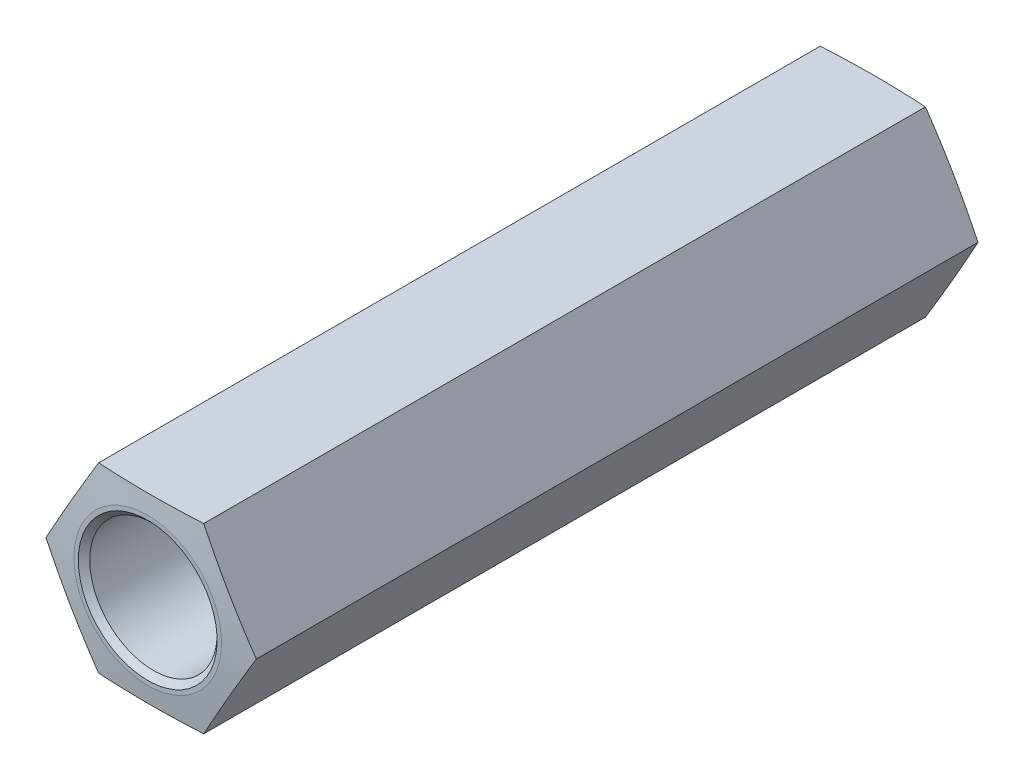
ISO-10303-21;
HEADER;
FILE_DESCRIPTION(('STEP AP214'),'2;1');
FILE_NAME('part.step','',(''),(''),'','','');
FILE_SCHEMA(('AUTOMOTIVE_DESIGN { 1 0 10303 214 1 1 1 1 }'));
ENDSEC;
DATA;
#1=APPLICATION_CONTEXT('core data for automotive mechanical design processes');
#2=APPLICATION_PROTOCOL_DEFINITION('international standard','automotive_design',2000,#1);
#3=PRODUCT_CONTEXT('',#1,'mechanical');
#4=PRODUCT('Part','Part','',(#3));
#5=PRODUCT_RELATED_PRODUCT_CATEGORY('part','',(#4));
#6=PRODUCT_DEFINITION_FORMATION('','',#4);
#7=PRODUCT_DEFINITION_CONTEXT('part definition',#1,'design');
#8=PRODUCT_DEFINITION('design','',#6,#7);
#9=PRODUCT_DEFINITION_SHAPE('','',#8);
#10=(LENGTH_UNIT() NAMED_UNIT(*) SI_UNIT(.MILLI.,.METRE.));
#11=(NAMED_UNIT(*) PLANE_ANGLE_UNIT() SI_UNIT($,.RADIAN.));
#12=(NAMED_UNIT(*) SI_UNIT($,.STERADIAN.) SOLID_ANGLE_UNIT());
#13=UNCERTAINTY_MEASURE_WITH_UNIT(LENGTH_MEASURE(1.E-05),#10,'distance_accuracy_value','');
#14=(GEOMETRIC_REPRESENTATION_CONTEXT(3) GLOBAL_UNCERTAINTY_ASSIGNED_CONTEXT((#13)) GLOBAL_UNIT_ASSIGNED_CONTEXT((#10,
#11,#12)) REPRESENTATION_CONTEXT('',''));
#15=CARTESIAN_POINT('',(0.,0.,0.));
#16=DIRECTION('',(0.,0.,1.));
#17=DIRECTION('',(1.,0.,0.));
#18=AXIS2_PLACEMENT_3D('',#15,#16,#17);
#19=CARTESIAN_POINT('',(3.6427233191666E-08,6.34999999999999,12.7));
#20=DIRECTION('',(0.,0.,-1.));
#21=DIRECTION('',(-1.,0.,0.));
#22=AXIS2_PLACEMENT_3D('',#19,#20,#21);
#23=PLANE('',#22);
#24=CARTESIAN_POINT('',(0.,-6.30938595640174E-08,12.7));
#25=DIRECTION('',(0.,0.,1.));
#26=DIRECTION('',(1.,0.,0.));
#27=AXIS2_PLACEMENT_3D('',#24,#25,#26);
#28=CIRCLE('',#27,2.57273925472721);
#29=CARTESIAN_POINT('',(2.57273925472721,-6.30938595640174E-08,12.7));
#30=VERTEX_POINT('',#29);
#31=EDGE_CURVE('E102',#30,#30,#28,.T.);
#32=ORIENTED_EDGE('',*,*,#31,.T.);
#33=EDGE_LOOP('',(#32));
#34=FACE_BOUND('',#33,.T.);
#35=CARTESIAN_POINT('',(0.,-6.30938595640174E-08,12.7));
#36=DIRECTION('',(0.,0.,-1.));
#37=DIRECTION('',(-1.,0.,0.));
#38=AXIS2_PLACEMENT_3D('',#35,#36,#37);
#39=CIRCLE('',#38,2.42000000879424);
#40=CARTESIAN_POINT('',(-2.42000000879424,-6.30938595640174E-08,12.7));
#41=VERTEX_POINT('',#40);
#42=EDGE_CURVE('E124',#41,#41,#39,.T.);
#43=ORIENTED_EDGE('',*,*,#42,.T.);
#44=EDGE_LOOP('',(#43));
#45=FACE_BOUND('',#44,.T.);
#46=ADVANCED_FACE('F30',(#34,#45),#23,.F.);
#47=CARTESIAN_POINT('',(3.6427233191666E-08,6.34999999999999,-12.7));
#48=DIRECTION('',(0.,0.,-1.));
#49=DIRECTION('',(-1.,0.,0.));
#50=AXIS2_PLACEMENT_3D('',#47,#48,#49);
#51=PLANE('',#50);
#52=CARTESIAN_POINT('',(0.,-6.30938595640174E-08,-12.7));
#53=DIRECTION('',(0.,0.,1.));
#54=DIRECTION('',(1.,0.,0.));
#55=AXIS2_PLACEMENT_3D('',#52,#53,#54);
#56=CIRCLE('',#55,2.57273925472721);
#57=CARTESIAN_POINT('',(2.57273925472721,-6.30938595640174E-08,-12.7));
#58=VERTEX_POINT('',#57);
#59=EDGE_CURVE('E222',#58,#58,#56,.T.);
#60=ORIENTED_EDGE('',*,*,#59,.F.);
#61=EDGE_LOOP('',(#60));
#62=FACE_BOUND('',#61,.T.);
#63=CARTESIAN_POINT('',(0.,-6.30938595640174E-08,-12.7));
#64=DIRECTION('',(0.,0.,-1.));
#65=DIRECTION('',(-1.,0.,0.));
#66=AXIS2_PLACEMENT_3D('',#63,#64,#65);
#67=CIRCLE('',#66,2.42000000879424);
#68=CARTESIAN_POINT('',(-2.42000000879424,-6.30938595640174E-08,-12.7));
#69=VERTEX_POINT('',#68);
#70=EDGE_CURVE('E127',#69,#69,#67,.F.);
#71=ORIENTED_EDGE('',*,*,#70,.T.);
#72=EDGE_LOOP('',(#71));
#73=FACE_BOUND('',#72,.T.);
#74=ADVANCED_FACE('F144',(#62,#73),#51,.T.);
#75=CARTESIAN_POINT('',(-1.83308710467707,3.17499993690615,12.7));
#76=DIRECTION('',(0.866025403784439,-0.5,0.));
#77=DIRECTION('',(0.5,0.866025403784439,0.));
#78=AXIS2_PLACEMENT_3D('',#75,#76,#77);
#79=PLANE('',#78);
#80=DIRECTION('',(0.,0.,-1.));
#81=VECTOR('',#80,1.);
#82=CARTESIAN_POINT('',(-3.66617420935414,-6.30938550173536E-08,12.7));
#83=LINE('',#82,#81);
#84=CARTESIAN_POINT('',(-3.66617420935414,-6.30938541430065E-08,12.58));
#85=VERTEX_POINT('',#84);
#86=CARTESIAN_POINT('',(-3.66617420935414,-6.30938541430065E-08,-12.58));
#87=VERTEX_POINT('',#86);
#88=EDGE_CURVE('E116',#85,#87,#83,.T.);
#89=ORIENTED_EDGE('',*,*,#88,.F.);
#90=CARTESIAN_POINT('',(-3.66628967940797,-0.000200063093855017,12.5799873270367));
#91=CARTESIAN_POINT('',(-3.58994462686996,0.132033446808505,12.5883701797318));
#92=CARTESIAN_POINT('',(-3.51357601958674,0.264307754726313,12.5959650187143));
#93=CARTESIAN_POINT('',(-3.36079345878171,0.528934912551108,12.6092901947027));
#94=CARTESIAN_POINT('',(-3.28437950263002,0.661287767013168,12.6150204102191));
#95=CARTESIAN_POINT('',(-3.13158459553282,0.925936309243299,12.6243226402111));
#96=CARTESIAN_POINT('',(-3.05520367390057,1.05823194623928,12.6278965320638));
#97=CARTESIAN_POINT('',(-2.90242538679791,1.32285170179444,12.6326873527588));
#98=CARTESIAN_POINT('',(-2.82602802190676,1.45517581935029,12.6339043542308));
#99=CARTESIAN_POINT('',(-2.67323329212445,1.719824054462,12.6339043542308));
#100=CARTESIAN_POINT('',(-2.5968359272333,1.85214817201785,12.6326873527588));
#101=CARTESIAN_POINT('',(-2.44405764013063,2.11676792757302,12.6278965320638));
#102=CARTESIAN_POINT('',(-2.36767671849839,2.249063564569,12.6243226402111));
#103=CARTESIAN_POINT('',(-2.21488181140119,2.51371210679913,12.6150204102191));
#104=CARTESIAN_POINT('',(-2.1384678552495,2.64606496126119,12.6092901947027));
#105=CARTESIAN_POINT('',(-1.98568529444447,2.91069211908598,12.5959650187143));
#106=CARTESIAN_POINT('',(-1.90931668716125,3.04296642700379,12.5883701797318));
#107=CARTESIAN_POINT('',(-1.83297163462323,3.17519993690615,12.5799873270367));
#108=B_SPLINE_CURVE_WITH_KNOTS('',3,(#90,#91,#92,#93,#94,#95,#96,#97,#98,#99,#100,#101,#102,
#103,#104,#105,#106,#107),.UNSPECIFIED.,.F.,.F.,(4,2,2,2,2,2,2,2,4),(0.,0.458763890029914,
0.917557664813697,1.37595141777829,1.83433104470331,2.29271067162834,2.75110442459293,
3.20989819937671,3.66866208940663),.UNSPECIFIED.);
#109=CARTESIAN_POINT('',(-1.83308710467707,3.17499993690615,12.58));
#110=VERTEX_POINT('',#109);
#111=EDGE_CURVE('E187',#85,#110,#108,.T.);
#112=ORIENTED_EDGE('',*,*,#111,.T.);
#113=DIRECTION('',(0.,0.,-1.));
#114=VECTOR('',#113,1.);
#115=CARTESIAN_POINT('',(-1.83308710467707,3.17499993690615,12.7));
#116=LINE('',#115,#114);
#117=CARTESIAN_POINT('',(-1.83308710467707,3.17499993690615,-12.58));
#118=VERTEX_POINT('',#117);
#119=EDGE_CURVE('E57',#110,#118,#116,.T.);
#120=ORIENTED_EDGE('',*,*,#119,.T.);
#121=CARTESIAN_POINT('',(-1.83297163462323,3.17519993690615,-12.5799873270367));
#122=CARTESIAN_POINT('',(-1.90931668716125,3.04296642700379,-12.5883701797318));
#123=CARTESIAN_POINT('',(-1.98568529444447,2.91069211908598,-12.5959650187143));
#124=CARTESIAN_POINT('',(-2.1384678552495,2.64606496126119,-12.6092901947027));
#125=CARTESIAN_POINT('',(-2.21488181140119,2.51371210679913,-12.6150204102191));
#126=CARTESIAN_POINT('',(-2.36767671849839,2.249063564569,-12.6243226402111));
#127=CARTESIAN_POINT('',(-2.44405764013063,2.11676792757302,-12.6278965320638));
#128=CARTESIAN_POINT('',(-2.5968359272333,1.85214817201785,-12.6326873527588));
#129=CARTESIAN_POINT('',(-2.67323329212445,1.719824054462,-12.6339043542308));
#130=CARTESIAN_POINT('',(-2.82602802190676,1.45517581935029,-12.6339043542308));
#131=CARTESIAN_POINT('',(-2.90242538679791,1.32285170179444,-12.6326873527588));
#132=CARTESIAN_POINT('',(-3.05520367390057,1.05823194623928,-12.6278965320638));
#133=CARTESIAN_POINT('',(-3.13158459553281,0.925936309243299,-12.6243226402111));
#134=CARTESIAN_POINT('',(-3.28437950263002,0.661287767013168,-12.6150204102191));
#135=CARTESIAN_POINT('',(-3.36079345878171,0.528934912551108,-12.6092901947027));
#136=CARTESIAN_POINT('',(-3.51357601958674,0.264307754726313,-12.5959650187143));
#137=CARTESIAN_POINT('',(-3.58994462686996,0.132033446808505,-12.5883701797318));
#138=CARTESIAN_POINT('',(-3.66628967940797,-0.000200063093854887,-12.5799873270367));
#139=B_SPLINE_CURVE_WITH_KNOTS('',3,(#121,#122,#123,#124,#125,#126,#127,#128,#129,#130,#131,
#132,#133,#134,#135,#136,#137,#138),.UNSPECIFIED.,.F.,.F.,(4,2,2,2,2,2,2,2,4),(0.,
0.458763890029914,0.917557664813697,1.37595141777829,1.83433104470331,2.29271067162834,
2.75110442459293,3.20989819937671,3.66866208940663),.UNSPECIFIED.);
#140=EDGE_CURVE('E209',#118,#87,#139,.T.);
#141=ORIENTED_EDGE('',*,*,#140,.T.);
#142=EDGE_LOOP('',(#89,#112,#120,#141));
#143=FACE_BOUND('',#142,.T.);
#144=ADVANCED_FACE('F196',(#143),#79,.F.);
#145=CARTESIAN_POINT('',(-3.66617420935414,-6.30938550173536E-08,12.7));
#146=DIRECTION('',(0.866025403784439,0.5,0.));
#147=DIRECTION('',(-0.5,0.866025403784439,0.));
#148=AXIS2_PLACEMENT_3D('',#145,#146,#147);
#149=PLANE('',#148);
#150=DIRECTION('',(0.,0.,-1.));
#151=VECTOR('',#150,1.);
#152=CARTESIAN_POINT('',(-1.83308710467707,-3.17500006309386,12.7));
#153=LINE('',#152,#151);
#154=CARTESIAN_POINT('',(-1.83308710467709,-3.17500006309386,12.58));
#155=VERTEX_POINT('',#154);
#156=CARTESIAN_POINT('',(-1.83308710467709,-3.17500006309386,-12.58));
#157=VERTEX_POINT('',#156);
#158=EDGE_CURVE('E110',#155,#157,#153,.T.);
#159=ORIENTED_EDGE('',*,*,#158,.F.);
#160=CARTESIAN_POINT('',(-1.83297163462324,-3.17520006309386,12.5799873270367));
#161=CARTESIAN_POINT('',(-1.90931668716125,-3.0429665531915,12.5883701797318));
#162=CARTESIAN_POINT('',(-1.98568529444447,-2.91069224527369,12.5959650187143));
#163=CARTESIAN_POINT('',(-2.1384678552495,-2.6460650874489,12.6092901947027));
#164=CARTESIAN_POINT('',(-2.21488181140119,-2.51371223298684,12.6150204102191));
#165=CARTESIAN_POINT('',(-2.36767671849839,-2.24906369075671,12.6243226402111));
#166=CARTESIAN_POINT('',(-2.44405764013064,-2.11676805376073,12.6278965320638));
#167=CARTESIAN_POINT('',(-2.5968359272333,-1.85214829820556,12.6326873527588));
#168=CARTESIAN_POINT('',(-2.67323329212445,-1.71982418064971,12.6339043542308));
#169=CARTESIAN_POINT('',(-2.82602802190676,-1.455175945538,12.6339043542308));
#170=CARTESIAN_POINT('',(-2.90242538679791,-1.32285182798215,12.6326873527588));
#171=CARTESIAN_POINT('',(-3.05520367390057,-1.05823207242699,12.6278965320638));
#172=CARTESIAN_POINT('',(-3.13158459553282,-0.925936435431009,12.6243226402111));
#173=CARTESIAN_POINT('',(-3.28437950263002,-0.661287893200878,12.6150204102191));
#174=CARTESIAN_POINT('',(-3.36079345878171,-0.528935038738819,12.6092901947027));
#175=CARTESIAN_POINT('',(-3.51357601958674,-0.264307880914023,12.5959650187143));
#176=CARTESIAN_POINT('',(-3.58994462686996,-0.132033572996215,12.5883701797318));
#177=CARTESIAN_POINT('',(-3.66628967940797,0.000199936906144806,12.5799873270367));
#178=B_SPLINE_CURVE_WITH_KNOTS('',3,(#160,#161,#162,#163,#164,#165,#166,#167,#168,#169,#170,
#171,#172,#173,#174,#175,#176,#177),.UNSPECIFIED.,.F.,.F.,(4,2,2,2,2,2,2,2,4),(0.,
0.458763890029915,0.917557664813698,1.37595141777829,1.83433104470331,2.29271067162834,
2.75110442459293,3.20989819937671,3.66866208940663),.UNSPECIFIED.);
#179=EDGE_CURVE('E181',#155,#85,#178,.T.);
#180=ORIENTED_EDGE('',*,*,#179,.T.);
#181=ORIENTED_EDGE('',*,*,#88,.T.);
#182=CARTESIAN_POINT('',(-3.66628967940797,0.000199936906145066,-12.5799873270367));
#183=CARTESIAN_POINT('',(-3.58994462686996,-0.132033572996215,-12.5883701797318));
#184=CARTESIAN_POINT('',(-3.51357601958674,-0.264307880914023,-12.5959650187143));
#185=CARTESIAN_POINT('',(-3.36079345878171,-0.528935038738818,-12.6092901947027));
#186=CARTESIAN_POINT('',(-3.28437950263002,-0.661287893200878,-12.6150204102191));
#187=CARTESIAN_POINT('',(-3.13158459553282,-0.925936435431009,-12.6243226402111));
#188=CARTESIAN_POINT('',(-3.05520367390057,-1.05823207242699,-12.6278965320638));
#189=CARTESIAN_POINT('',(-2.90242538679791,-1.32285182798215,-12.6326873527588));
#190=CARTESIAN_POINT('',(-2.82602802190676,-1.455175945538,-12.6339043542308));
#191=CARTESIAN_POINT('',(-2.67323329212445,-1.71982418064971,-12.6339043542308));
#192=CARTESIAN_POINT('',(-2.5968359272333,-1.85214829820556,-12.6326873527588));
#193=CARTESIAN_POINT('',(-2.44405764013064,-2.11676805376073,-12.6278965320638));
#194=CARTESIAN_POINT('',(-2.36767671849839,-2.24906369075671,-12.6243226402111));
#195=CARTESIAN_POINT('',(-2.21488181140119,-2.51371223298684,-12.6150204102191));
#196=CARTESIAN_POINT('',(-2.1384678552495,-2.6460650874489,-12.6092901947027));
#197=CARTESIAN_POINT('',(-1.98568529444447,-2.91069224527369,-12.5959650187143));
#198=CARTESIAN_POINT('',(-1.90931668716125,-3.0429665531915,-12.5883701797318));
#199=CARTESIAN_POINT('',(-1.83297163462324,-3.17520006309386,-12.5799873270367));
#200=B_SPLINE_CURVE_WITH_KNOTS('',3,(#182,#183,#184,#185,#186,#187,#188,#189,#190,#191,#192,
#193,#194,#195,#196,#197,#198,#199),.UNSPECIFIED.,.F.,.F.,(4,2,2,2,2,2,2,2,4),(0.,
0.458763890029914,0.917557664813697,1.37595141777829,1.83433104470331,2.29271067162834,
2.75110442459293,3.20989819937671,3.66866208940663),.UNSPECIFIED.);
#201=EDGE_CURVE('E202',#87,#157,#200,.T.);
#202=ORIENTED_EDGE('',*,*,#201,.T.);
#203=EDGE_LOOP('',(#159,#180,#181,#202));
#204=FACE_BOUND('',#203,.T.);
#205=ADVANCED_FACE('F192',(#204),#149,.F.);
#206=CARTESIAN_POINT('',(-1.83308710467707,-3.17500006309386,12.7));
#207=DIRECTION('',(-3.44194550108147E-08,0.999999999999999,0.));
#208=DIRECTION('',(-0.999999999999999,-3.44194550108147E-08,0.));
#209=AXIS2_PLACEMENT_3D('',#206,#207,#208);
#210=PLANE('',#209);
#211=DIRECTION('',(0.,0.,-1.));
#212=VECTOR('',#211,1.);
#213=CARTESIAN_POINT('',(1.83308710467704,-3.17499993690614,12.7));
#214=LINE('',#213,#212);
#215=CARTESIAN_POINT('',(1.83308699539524,-3.17500012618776,12.58));
#216=VERTEX_POINT('',#215);
#217=CARTESIAN_POINT('',(1.83308699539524,-3.17500012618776,-12.58));
#218=VERTEX_POINT('',#217);
#219=EDGE_CURVE('E108',#216,#218,#214,.T.);
#220=ORIENTED_EDGE('',*,*,#219,.F.);
#221=CARTESIAN_POINT('',(-4.83494791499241,-3.17500016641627,12.3475517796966));
#222=CARTESIAN_POINT('',(-4.69083344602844,-3.17500016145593,12.3607700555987));
#223=CARTESIAN_POINT('',(-4.54670317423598,-3.17500015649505,12.3738162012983));
#224=CARTESIAN_POINT('',(-4.25840335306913,-3.17500014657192,12.3994791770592));
#225=CARTESIAN_POINT('',(-4.11423380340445,-3.17500014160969,12.4120960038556));
#226=CARTESIAN_POINT('',(-3.68161123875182,-3.17500012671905,12.4491786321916));
#227=CARTESIAN_POINT('',(-3.39309105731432,-3.17500011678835,12.4728722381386));
#228=CARTESIAN_POINT('',(-2.81617995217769,-3.17500009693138,12.5171363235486));
#229=CARTESIAN_POINT('',(-2.52778933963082,-3.17500008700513,12.5377107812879));
#230=CARTESIAN_POINT('',(-1.95071438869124,-3.17500006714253,12.574212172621));
#231=CARTESIAN_POINT('',(-1.66203005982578,-3.17500005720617,12.5901392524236));
#232=CARTESIAN_POINT('',(-1.08383678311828,-3.17500003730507,12.6153055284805));
#233=CARTESIAN_POINT('',(-0.794327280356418,-3.17500002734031,12.6245328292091));
#234=CARTESIAN_POINT('',(-0.359965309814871,-3.17500001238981,12.6320264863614));
#235=CARTESIAN_POINT('',(-0.215165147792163,-3.17500000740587,12.6334665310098));
#236=CARTESIAN_POINT('',(0.0744404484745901,-3.1749999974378,12.6341710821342));
#237=CARTESIAN_POINT('',(0.21924588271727,-3.17499999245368,12.6334355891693));
#238=CARTESIAN_POINT('',(0.653794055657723,-3.17499997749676,12.6279910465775));
#239=CARTESIAN_POINT('',(0.943499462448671,-3.17499996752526,12.6200410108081));
#240=CARTESIAN_POINT('',(1.5226385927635,-3.17499994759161,12.5970571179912));
#241=CARTESIAN_POINT('',(1.81207228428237,-3.17499993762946,12.5820225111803));
#242=CARTESIAN_POINT('',(2.37658945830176,-3.17499991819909,12.5478298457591));
#243=CARTESIAN_POINT('',(2.65168769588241,-3.17499990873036,12.5289073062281));
#244=CARTESIAN_POINT('',(3.20165867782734,-3.17499988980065,12.4879990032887));
#245=CARTESIAN_POINT('',(3.47653141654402,-3.17499988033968,12.4660131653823));
#246=CARTESIAN_POINT('',(4.02611836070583,-3.1749998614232,12.419972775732));
#247=CARTESIAN_POINT('',(4.30083255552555,-3.17499985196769,12.3959180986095));
#248=CARTESIAN_POINT('',(4.85013324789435,-3.17499983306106,12.3463896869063));
#249=CARTESIAN_POINT('',(5.12471974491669,-3.17499982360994,12.3209159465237));
#250=CARTESIAN_POINT('',(5.6733434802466,-3.17499980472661,12.2690145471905));
#251=CARTESIAN_POINT('',(5.94738087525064,-3.17499979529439,12.2425885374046));
#252=CARTESIAN_POINT('',(6.49538629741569,-3.17499977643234,12.1890190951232));
#253=CARTESIAN_POINT('',(6.76935432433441,-3.17499976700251,12.161875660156));
#254=CARTESIAN_POINT('',(7.31716608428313,-3.17499974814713,12.1070676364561));
#255=CARTESIAN_POINT('',(7.59100983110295,-3.17499973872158,12.0794031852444));
#256=CARTESIAN_POINT('',(8.13865420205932,-3.17499971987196,12.0236676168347));
#257=CARTESIAN_POINT('',(8.41245482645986,-3.17499971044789,11.9955965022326));
#258=CARTESIAN_POINT('',(8.6862405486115,-3.17499970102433,11.9673825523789));
#259=B_SPLINE_CURVE_WITH_KNOTS('',3,(#221,#222,#223,#224,#225,#226,#227,#228,#229,#230,#231,
#232,#233,#234,#235,#236,#237,#238,#239,#240,#241,#242,#243,#244,#245,#246,#247,#248,#249,#250,
#251,#252,#253,#254,#255,#256,#257,#258),.UNSPECIFIED.,.F.,.F.,(4,2,2,2,2,2,2,2,2,2,2,2,2,2,2,2,
2,2,4),(0.,0.434157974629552,0.86831925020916,1.7367826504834,2.60412888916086,3.47144783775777,
4.34030297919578,4.77470987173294,5.20911665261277,6.07843767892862,6.94785072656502,
7.77507130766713,8.60231200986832,9.42960288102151,10.2568971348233,11.0828216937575,
11.9087490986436,12.734461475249,13.5601685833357),.UNSPECIFIED.);
#260=EDGE_CURVE('E90',#216,#155,#259,.F.);
#261=ORIENTED_EDGE('',*,*,#260,.T.);
#262=ORIENTED_EDGE('',*,*,#158,.T.);
#263=CARTESIAN_POINT('',(-4.83494791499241,-3.17500016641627,-12.3475517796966));
#264=CARTESIAN_POINT('',(-4.69083344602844,-3.17500016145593,-12.3607700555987));
#265=CARTESIAN_POINT('',(-4.54670317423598,-3.17500015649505,-12.3738162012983));
#266=CARTESIAN_POINT('',(-4.25840335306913,-3.17500014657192,-12.3994791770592));
#267=CARTESIAN_POINT('',(-4.11423380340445,-3.17500014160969,-12.4120960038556));
#268=CARTESIAN_POINT('',(-3.68161123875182,-3.17500012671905,-12.4491786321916));
#269=CARTESIAN_POINT('',(-3.39309105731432,-3.17500011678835,-12.4728722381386));
#270=CARTESIAN_POINT('',(-2.81617995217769,-3.17500009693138,-12.5171363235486));
#271=CARTESIAN_POINT('',(-2.52778933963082,-3.17500008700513,-12.5377107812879));
#272=CARTESIAN_POINT('',(-1.95071438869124,-3.17500006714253,-12.574212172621));
#273=CARTESIAN_POINT('',(-1.66203005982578,-3.17500005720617,-12.5901392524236));
#274=CARTESIAN_POINT('',(-1.08383678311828,-3.17500003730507,-12.6153055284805));
#275=CARTESIAN_POINT('',(-0.794327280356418,-3.17500002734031,-12.6245328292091));
#276=CARTESIAN_POINT('',(-0.359965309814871,-3.17500001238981,-12.6320264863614));
#277=CARTESIAN_POINT('',(-0.215165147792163,-3.17500000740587,-12.6334665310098));
#278=CARTESIAN_POINT('',(0.0744404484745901,-3.1749999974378,-12.6341710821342));
#279=CARTESIAN_POINT('',(0.21924588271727,-3.17499999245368,-12.6334355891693));
#280=CARTESIAN_POINT('',(0.653794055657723,-3.17499997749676,-12.6279910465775));
#281=CARTESIAN_POINT('',(0.943499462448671,-3.17499996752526,-12.6200410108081));
#282=CARTESIAN_POINT('',(1.5226385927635,-3.17499994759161,-12.5970571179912));
#283=CARTESIAN_POINT('',(1.81207228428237,-3.17499993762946,-12.5820225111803));
#284=CARTESIAN_POINT('',(2.37658945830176,-3.17499991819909,-12.5478298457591));
#285=CARTESIAN_POINT('',(2.65168769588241,-3.17499990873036,-12.5289073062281));
#286=CARTESIAN_POINT('',(3.20165867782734,-3.17499988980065,-12.4879990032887));
#287=CARTESIAN_POINT('',(3.47653141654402,-3.17499988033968,-12.4660131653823));
#288=CARTESIAN_POINT('',(4.02611836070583,-3.1749998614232,-12.419972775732));
#289=CARTESIAN_POINT('',(4.30083255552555,-3.17499985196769,-12.3959180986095));
#290=CARTESIAN_POINT('',(4.85013324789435,-3.17499983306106,-12.3463896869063));
#291=CARTESIAN_POINT('',(5.12471974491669,-3.17499982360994,-12.3209159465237));
#292=CARTESIAN_POINT('',(5.6733434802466,-3.17499980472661,-12.2690145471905));
#293=CARTESIAN_POINT('',(5.94738087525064,-3.17499979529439,-12.2425885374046));
#294=CARTESIAN_POINT('',(6.49538629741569,-3.17499977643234,-12.1890190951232));
#295=CARTESIAN_POINT('',(6.76935432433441,-3.17499976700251,-12.161875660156));
#296=CARTESIAN_POINT('',(7.31716608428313,-3.17499974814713,-12.1070676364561));
#297=CARTESIAN_POINT('',(7.59100983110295,-3.17499973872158,-12.0794031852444));
#298=CARTESIAN_POINT('',(8.13865420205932,-3.17499971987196,-12.0236676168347));
#299=CARTESIAN_POINT('',(8.41245482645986,-3.17499971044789,-11.9955965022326));
#300=CARTESIAN_POINT('',(8.6862405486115,-3.17499970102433,-11.9673825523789));
#301=B_SPLINE_CURVE_WITH_KNOTS('',3,(#263,#264,#265,#266,#267,#268,#269,#270,#271,#272,#273,
#274,#275,#276,#277,#278,#279,#280,#281,#282,#283,#284,#285,#286,#287,#288,#289,#290,#291,#292,
#293,#294,#295,#296,#297,#298,#299,#300),.UNSPECIFIED.,.F.,.F.,(4,2,2,2,2,2,2,2,2,2,2,2,2,2,2,2,
2,2,4),(0.,0.434157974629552,0.86831925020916,1.7367826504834,2.60412888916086,3.47144783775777,
4.34030297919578,4.77470987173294,5.20911665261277,6.07843767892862,6.94785072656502,
7.77507130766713,8.60231200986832,9.42960288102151,10.2568971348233,11.0828216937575,
11.9087490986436,12.734461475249,13.5601685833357),.UNSPECIFIED.);
#302=EDGE_CURVE('E210',#157,#218,#301,.T.);
#303=ORIENTED_EDGE('',*,*,#302,.T.);
#304=EDGE_LOOP('',(#220,#261,#262,#303));
#305=FACE_BOUND('',#304,.T.);
#306=ADVANCED_FACE('F195',(#305),#210,.F.);
#307=CARTESIAN_POINT('',(1.83308710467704,-3.17499993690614,12.7));
#308=DIRECTION('',(-0.866025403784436,0.500000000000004,0.));
#309=DIRECTION('',(-0.500000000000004,-0.866025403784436,0.));
#310=AXIS2_PLACEMENT_3D('',#307,#308,#309);
#311=PLANE('',#310);
#312=DIRECTION('',(0.,0.,-1.));
#313=VECTOR('',#312,1.);
#314=CARTESIAN_POINT('',(3.66617420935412,6.3093853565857E-08,12.7));
#315=LINE('',#314,#313);
#316=CARTESIAN_POINT('',(3.66617420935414,6.30938224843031E-08,12.58));
#317=VERTEX_POINT('',#316);
#318=CARTESIAN_POINT('',(3.66617420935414,6.30938224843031E-08,-12.58));
#319=VERTEX_POINT('',#318);
#320=EDGE_CURVE('E99',#317,#319,#315,.T.);
#321=ORIENTED_EDGE('',*,*,#320,.F.);
#322=CARTESIAN_POINT('',(3.66628967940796,0.000200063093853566,12.5799873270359));
#323=CARTESIAN_POINT('',(3.58994462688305,-0.132033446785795,12.5883701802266));
#324=CARTESIAN_POINT('',(3.51357601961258,-0.264307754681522,12.5959650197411));
#325=CARTESIAN_POINT('',(3.36079345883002,-0.528934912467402,12.6092901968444));
#326=CARTESIAN_POINT('',(3.28437950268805,-0.661287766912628,12.6150204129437));
#327=CARTESIAN_POINT('',(3.13158459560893,-0.925936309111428,12.6243226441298));
#328=CARTESIAN_POINT('',(3.05520367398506,-1.0582319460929,12.6278965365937));
#329=CARTESIAN_POINT('',(2.90242538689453,-1.32285170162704,12.6326873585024));
#330=CARTESIAN_POINT('',(2.82602802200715,-1.45517581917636,12.6339043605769));
#331=CARTESIAN_POINT('',(2.67323329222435,-1.71982405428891,12.6339043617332));
#332=CARTESIAN_POINT('',(2.59683592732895,-1.85214817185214,12.6326873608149));
#333=CARTESIAN_POINT('',(2.44405764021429,-2.11676792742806,12.6278965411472));
#334=CARTESIAN_POINT('',(2.36767671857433,-2.24906356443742,12.6243226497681));
#335=CARTESIAN_POINT('',(2.21488181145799,-2.51371210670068,12.6150204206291));
#336=CARTESIAN_POINT('',(2.1384678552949,-2.64606496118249,12.6092902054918));
#337=CARTESIAN_POINT('',(1.9856852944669,-2.91069211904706,12.5959650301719));
#338=CARTESIAN_POINT('',(1.90931668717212,-3.0429664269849,12.5883701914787));
#339=CARTESIAN_POINT('',(1.8329716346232,-3.17519993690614,12.5799873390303));
#340=B_SPLINE_CURVE_WITH_KNOTS('',3,(#322,#323,#324,#325,#326,#327,#328,#329,#330,#331,#332,
#333,#334,#335,#336,#337,#338,#339),.UNSPECIFIED.,.F.,.F.,(4,2,2,2,2,2,2,2,4),(0.,
0.45876389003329,0.917557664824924,1.37595141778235,1.8343310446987,2.29271067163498,
2.75110442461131,3.20989819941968,3.66866208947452),.UNSPECIFIED.);
#341=EDGE_CURVE('E87',#317,#216,#340,.T.);
#342=ORIENTED_EDGE('',*,*,#341,.T.);
#343=ORIENTED_EDGE('',*,*,#219,.T.);
#344=CARTESIAN_POINT('',(1.8329716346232,-3.17519993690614,-12.5799873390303));
#345=CARTESIAN_POINT('',(1.90931668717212,-3.0429664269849,-12.5883701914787));
#346=CARTESIAN_POINT('',(1.9856852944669,-2.91069211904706,-12.5959650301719));
#347=CARTESIAN_POINT('',(2.1384678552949,-2.64606496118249,-12.6092902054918));
#348=CARTESIAN_POINT('',(2.21488181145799,-2.51371210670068,-12.6150204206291));
#349=CARTESIAN_POINT('',(2.36767671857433,-2.24906356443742,-12.6243226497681));
#350=CARTESIAN_POINT('',(2.44405764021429,-2.11676792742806,-12.6278965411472));
#351=CARTESIAN_POINT('',(2.59683592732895,-1.85214817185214,-12.6326873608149));
#352=CARTESIAN_POINT('',(2.67323329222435,-1.71982405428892,-12.6339043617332));
#353=CARTESIAN_POINT('',(2.82602802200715,-1.45517581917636,-12.6339043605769));
#354=CARTESIAN_POINT('',(2.90242538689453,-1.32285170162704,-12.6326873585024));
#355=CARTESIAN_POINT('',(3.05520367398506,-1.0582319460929,-12.6278965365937));
#356=CARTESIAN_POINT('',(3.13158459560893,-0.925936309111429,-12.6243226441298));
#357=CARTESIAN_POINT('',(3.28437950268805,-0.661287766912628,-12.6150204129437));
#358=CARTESIAN_POINT('',(3.36079345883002,-0.528934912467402,-12.6092901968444));
#359=CARTESIAN_POINT('',(3.51357601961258,-0.264307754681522,-12.5959650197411));
#360=CARTESIAN_POINT('',(3.58994462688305,-0.132033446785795,-12.5883701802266));
#361=CARTESIAN_POINT('',(3.66628967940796,0.000200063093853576,-12.5799873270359));
#362=B_SPLINE_CURVE_WITH_KNOTS('',3,(#344,#345,#346,#347,#348,#349,#350,#351,#352,#353,#354,
#355,#356,#357,#358,#359,#360,#361),.UNSPECIFIED.,.F.,.F.,(4,2,2,2,2,2,2,2,4),(0.,
0.458763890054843,0.917557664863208,1.37595141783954,1.83433104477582,2.29271067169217,
2.7511044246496,3.20989819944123,3.66866208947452),.UNSPECIFIED.);
#363=EDGE_CURVE('E107',#218,#319,#362,.T.);
#364=ORIENTED_EDGE('',*,*,#363,.T.);
#365=EDGE_LOOP('',(#321,#342,#343,#364));
#366=FACE_BOUND('',#365,.T.);
#367=ADVANCED_FACE('F105',(#366),#311,.F.);
#368=CARTESIAN_POINT('',(3.66617420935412,6.3093853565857E-08,12.7));
#369=DIRECTION('',(-0.866025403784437,-0.500000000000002,0.));
#370=DIRECTION('',(0.500000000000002,-0.866025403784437,0.));
#371=AXIS2_PLACEMENT_3D('',#368,#369,#370);
#372=PLANE('',#371);
#373=DIRECTION('',(0.,0.,-1.));
#374=VECTOR('',#373,1.);
#375=CARTESIAN_POINT('',(1.83308710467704,3.17500006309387,12.7));
#376=LINE('',#375,#374);
#377=CARTESIAN_POINT('',(1.83308710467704,3.17500006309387,12.5799999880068));
#378=VERTEX_POINT('',#377);
#379=CARTESIAN_POINT('',(1.83308688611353,3.17500006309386,-12.58));
#380=VERTEX_POINT('',#379);
#381=EDGE_CURVE('E101',#378,#380,#376,.T.);
#382=ORIENTED_EDGE('',*,*,#381,.F.);
#383=CARTESIAN_POINT('',(1.8329716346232,3.17520006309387,12.5799873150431));
#384=CARTESIAN_POINT('',(1.90931668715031,3.04296655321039,12.5883701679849));
#385=CARTESIAN_POINT('',(1.98568529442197,2.91069224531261,12.5959650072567));
#386=CARTESIAN_POINT('',(2.13846785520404,2.64606508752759,12.6092901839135));
#387=CARTESIAN_POINT('',(2.21488181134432,2.51371223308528,12.6150203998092));
#388=CARTESIAN_POINT('',(2.3676767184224,2.24906369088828,12.6243226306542));
#389=CARTESIAN_POINT('',(2.44405764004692,2.11676805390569,12.6278965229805));
#390=CARTESIAN_POINT('',(2.5968359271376,1.85214829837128,12.6326873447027));
#391=CARTESIAN_POINT('',(2.6732332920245,1.71982418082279,12.6339043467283));
#392=CARTESIAN_POINT('',(2.82602802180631,1.45517594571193,12.6339043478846));
#393=CARTESIAN_POINT('',(2.90242538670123,1.32285182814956,12.6326873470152));
#394=CARTESIAN_POINT('',(3.05520367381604,1.05823207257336,12.627896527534));
#395=CARTESIAN_POINT('',(3.13158459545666,0.925936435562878,12.6243226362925));
#396=CARTESIAN_POINT('',(3.28437950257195,0.661287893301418,12.6150204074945));
#397=CARTESIAN_POINT('',(3.36079345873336,0.528935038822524,12.609290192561));
#398=CARTESIAN_POINT('',(3.51357601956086,0.264307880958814,12.5959650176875));
#399=CARTESIAN_POINT('',(3.58994462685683,0.132033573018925,12.588370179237));
#400=CARTESIAN_POINT('',(3.66628967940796,-0.000199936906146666,12.5799873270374));
#401=B_SPLINE_CURVE_WITH_KNOTS('',3,(#383,#384,#385,#386,#387,#388,#389,#390,#391,#392,#393,
#394,#395,#396,#397,#398,#399,#400),.UNSPECIFIED.,.F.,.F.,(4,2,2,2,2,2,2,2,4),(0.,
0.458763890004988,0.917557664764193,1.37595141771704,1.83433104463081,2.29271067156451,
2.75110442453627,3.20989819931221,3.66866208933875),.UNSPECIFIED.);
#402=EDGE_CURVE('E50',#378,#317,#401,.T.);
#403=ORIENTED_EDGE('',*,*,#402,.T.);
#404=ORIENTED_EDGE('',*,*,#320,.T.);
#405=CARTESIAN_POINT('',(3.66628967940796,-0.000199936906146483,-12.5799873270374));
#406=CARTESIAN_POINT('',(3.58994462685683,0.132033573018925,-12.588370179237));
#407=CARTESIAN_POINT('',(3.51357601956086,0.264307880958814,-12.5959650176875));
#408=CARTESIAN_POINT('',(3.36079345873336,0.528935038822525,-12.609290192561));
#409=CARTESIAN_POINT('',(3.28437950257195,0.661287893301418,-12.6150204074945));
#410=CARTESIAN_POINT('',(3.13158459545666,0.925936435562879,-12.6243226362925));
#411=CARTESIAN_POINT('',(3.05520367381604,1.05823207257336,-12.627896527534));
#412=CARTESIAN_POINT('',(2.90242538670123,1.32285182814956,-12.6326873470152));
#413=CARTESIAN_POINT('',(2.82602802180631,1.45517594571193,-12.6339043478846));
#414=CARTESIAN_POINT('',(2.6732332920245,1.71982418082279,-12.6339043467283));
#415=CARTESIAN_POINT('',(2.5968359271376,1.85214829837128,-12.6326873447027));
#416=CARTESIAN_POINT('',(2.44405764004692,2.11676805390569,-12.6278965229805));
#417=CARTESIAN_POINT('',(2.3676767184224,2.24906369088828,-12.6243226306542));
#418=CARTESIAN_POINT('',(2.21488181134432,2.51371223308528,-12.6150203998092));
#419=CARTESIAN_POINT('',(2.13846785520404,2.64606508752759,-12.6092901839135));
#420=CARTESIAN_POINT('',(1.98568529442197,2.91069224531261,-12.5959650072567));
#421=CARTESIAN_POINT('',(1.90931668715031,3.04296655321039,-12.5883701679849));
#422=CARTESIAN_POINT('',(1.8329716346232,3.17520006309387,-12.5799873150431));
#423=B_SPLINE_CURVE_WITH_KNOTS('',3,(#405,#406,#407,#408,#409,#410,#411,#412,#413,#414,#415,
#416,#417,#418,#419,#420,#421,#422),.UNSPECIFIED.,.F.,.F.,(4,2,2,2,2,2,2,2,4),(0.,
0.45876389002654,0.917557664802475,1.37595141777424,1.83433104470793,2.2927106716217,
2.75110442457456,3.20989819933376,3.66866208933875),.UNSPECIFIED.);
#424=EDGE_CURVE('E154',#319,#380,#423,.T.);
#425=ORIENTED_EDGE('',*,*,#424,.T.);
#426=EDGE_LOOP('',(#382,#403,#404,#425));
#427=FACE_BOUND('',#426,.T.);
#428=ADVANCED_FACE('F97',(#427),#372,.F.);
#429=CARTESIAN_POINT('',(1.83308710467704,3.17500006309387,12.7));
#430=DIRECTION('',(3.44194550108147E-08,-0.999999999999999,0.));
#431=DIRECTION('',(1.,3.44194550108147E-08,0.));
#432=AXIS2_PLACEMENT_3D('',#429,#430,#431);
#433=PLANE('',#432);
#434=ORIENTED_EDGE('',*,*,#119,.F.);
#435=CARTESIAN_POINT('',(-4.8349521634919,3.17499983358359,12.3475514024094));
#436=CARTESIAN_POINT('',(-4.69083751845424,3.17499983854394,12.3607696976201));
#437=CARTESIAN_POINT('',(-4.54670707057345,3.17499984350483,12.3738158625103));
#438=CARTESIAN_POINT('',(-4.25840689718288,3.17499985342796,12.399478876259));
#439=CARTESIAN_POINT('',(-4.11423717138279,3.17499985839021,12.4120957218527));
#440=CARTESIAN_POINT('',(-3.68161407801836,3.17499987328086,12.4491784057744));
#441=CARTESIAN_POINT('',(-3.39309354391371,3.17499988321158,12.4728720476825));
#442=CARTESIAN_POINT('',(-2.81618173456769,3.17499990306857,12.5171362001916));
#443=CARTESIAN_POINT('',(-2.52779077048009,3.17499991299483,12.5377106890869));
#444=CARTESIAN_POINT('',(-1.95071511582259,3.17499993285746,12.5742121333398));
#445=CARTESIAN_POINT('',(-1.66203043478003,3.17499994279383,12.5901392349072));
#446=CARTESIAN_POINT('',(-1.08383644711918,3.17499996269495,12.6153055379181));
#447=CARTESIAN_POINT('',(-0.794326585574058,3.17499997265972,12.6245328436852));
#448=CARTESIAN_POINT('',(-0.359964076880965,3.17499998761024,12.6320264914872));
#449=CARTESIAN_POINT('',(-0.21516373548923,3.17499999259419,12.6334665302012));
#450=CARTESIAN_POINT('',(0.0744422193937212,3.17500000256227,12.6341710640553));
#451=CARTESIAN_POINT('',(0.219247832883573,3.1750000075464,12.6334355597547));
#452=CARTESIAN_POINT('',(0.653796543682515,3.17500002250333,12.6279909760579));
#453=CARTESIAN_POINT('',(0.943502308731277,3.17500003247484,12.6200409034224));
#454=CARTESIAN_POINT('',(1.52264215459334,3.17500005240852,12.5970569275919));
#455=CARTESIAN_POINT('',(1.81207620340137,3.17500006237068,12.5820222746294));
#456=CARTESIAN_POINT('',(2.37659373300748,3.17500008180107,12.5478295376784));
#457=CARTESIAN_POINT('',(2.6516919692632,3.1750000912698,12.5289069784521));
#458=CARTESIAN_POINT('',(3.20166294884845,3.1750001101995,12.4879986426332));
#459=CARTESIAN_POINT('',(3.47653568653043,3.17500011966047,12.4660127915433));
#460=CARTESIAN_POINT('',(4.0261226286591,3.17500013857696,12.4199723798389));
#461=CARTESIAN_POINT('',(4.30083682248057,3.17500014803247,12.3959176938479));
#462=CARTESIAN_POINT('',(4.85013751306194,3.1750001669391,12.3463892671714));
#463=CARTESIAN_POINT('',(5.12472400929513,3.17500017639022,12.320915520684));
#464=CARTESIAN_POINT('',(5.67334774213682,3.17500019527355,12.2690141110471));
#465=CARTESIAN_POINT('',(5.94738513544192,3.17500020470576,12.2425880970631));
#466=CARTESIAN_POINT('',(6.49539055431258,3.17500022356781,12.1890186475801));
#467=CARTESIAN_POINT('',(6.76935857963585,3.17500023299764,12.1618752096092));
#468=CARTESIAN_POINT('',(7.31717033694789,3.17500025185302,12.107067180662));
#469=CARTESIAN_POINT('',(7.59101408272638,3.17500026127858,12.0794027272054));
#470=CARTESIAN_POINT('',(8.13865845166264,3.1750002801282,12.0236671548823));
#471=CARTESIAN_POINT('',(8.41245907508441,3.17500028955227,11.9955960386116));
#472=CARTESIAN_POINT('',(8.68624479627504,3.17500029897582,11.967382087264));
#473=B_SPLINE_CURVE_WITH_KNOTS('',3,(#435,#436,#437,#438,#439,#440,#441,#442,#443,#444,#445,
#446,#447,#448,#449,#450,#451,#452,#453,#454,#455,#456,#457,#458,#459,#460,#461,#462,#463,#464,
#465,#466,#467,#468,#469,#470,#471,#472),.UNSPECIFIED.,.F.,.F.,(4,2,2,2,2,2,2,2,2,2,2,2,2,2,2,2,
2,2,4),(0.,0.434158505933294,0.868320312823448,1.73678477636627,2.60413207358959,
3.47145208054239,4.34030829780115,4.77471572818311,5.20912304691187,6.07844515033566,
6.94785927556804,7.77507985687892,8.60232055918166,9.42961142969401,10.2569056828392,
11.0828302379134,11.9087576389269,12.734470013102,13.5601771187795),.UNSPECIFIED.);
#474=EDGE_CURVE('E11',#110,#378,#473,.T.);
#475=ORIENTED_EDGE('',*,*,#474,.T.);
#476=ORIENTED_EDGE('',*,*,#381,.T.);
#477=CARTESIAN_POINT('',(-4.8349521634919,3.17499983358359,-12.3475514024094));
#478=CARTESIAN_POINT('',(-4.69083751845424,3.17499983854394,-12.3607696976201));
#479=CARTESIAN_POINT('',(-4.54670707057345,3.17499984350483,-12.3738158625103));
#480=CARTESIAN_POINT('',(-4.25840689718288,3.17499985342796,-12.399478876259));
#481=CARTESIAN_POINT('',(-4.11423717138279,3.17499985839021,-12.4120957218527));
#482=CARTESIAN_POINT('',(-3.68161407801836,3.17499987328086,-12.4491784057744));
#483=CARTESIAN_POINT('',(-3.39309354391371,3.17499988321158,-12.4728720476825));
#484=CARTESIAN_POINT('',(-2.81618173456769,3.17499990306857,-12.5171362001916));
#485=CARTESIAN_POINT('',(-2.52779077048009,3.17499991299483,-12.5377106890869));
#486=CARTESIAN_POINT('',(-1.95071511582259,3.17499993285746,-12.5742121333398));
#487=CARTESIAN_POINT('',(-1.66203043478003,3.17499994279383,-12.5901392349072));
#488=CARTESIAN_POINT('',(-1.08383644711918,3.17499996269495,-12.6153055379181));
#489=CARTESIAN_POINT('',(-0.794326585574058,3.17499997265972,-12.6245328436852));
#490=CARTESIAN_POINT('',(-0.359964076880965,3.17499998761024,-12.6320264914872));
#491=CARTESIAN_POINT('',(-0.21516373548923,3.17499999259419,-12.6334665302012));
#492=CARTESIAN_POINT('',(0.0744422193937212,3.17500000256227,-12.6341710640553));
#493=CARTESIAN_POINT('',(0.219247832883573,3.1750000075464,-12.6334355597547));
#494=CARTESIAN_POINT('',(0.653796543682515,3.17500002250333,-12.6279909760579));
#495=CARTESIAN_POINT('',(0.943502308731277,3.17500003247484,-12.6200409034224));
#496=CARTESIAN_POINT('',(1.52264215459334,3.17500005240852,-12.5970569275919));
#497=CARTESIAN_POINT('',(1.81207620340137,3.17500006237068,-12.5820222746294));
#498=CARTESIAN_POINT('',(2.37659373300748,3.17500008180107,-12.5478295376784));
#499=CARTESIAN_POINT('',(2.6516919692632,3.1750000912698,-12.5289069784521));
#500=CARTESIAN_POINT('',(3.20166294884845,3.1750001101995,-12.4879986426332));
#501=CARTESIAN_POINT('',(3.47653568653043,3.17500011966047,-12.4660127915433));
#502=CARTESIAN_POINT('',(4.0261226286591,3.17500013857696,-12.4199723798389));
#503=CARTESIAN_POINT('',(4.30083682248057,3.17500014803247,-12.3959176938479));
#504=CARTESIAN_POINT('',(4.85013751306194,3.1750001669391,-12.3463892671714));
#505=CARTESIAN_POINT('',(5.12472400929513,3.17500017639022,-12.320915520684));
#506=CARTESIAN_POINT('',(5.67334774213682,3.17500019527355,-12.2690141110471));
#507=CARTESIAN_POINT('',(5.94738513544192,3.17500020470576,-12.2425880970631));
#508=CARTESIAN_POINT('',(6.49539055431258,3.17500022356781,-12.1890186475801));
#509=CARTESIAN_POINT('',(6.76935857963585,3.17500023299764,-12.1618752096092));
#510=CARTESIAN_POINT('',(7.31717033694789,3.17500025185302,-12.107067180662));
#511=CARTESIAN_POINT('',(7.59101408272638,3.17500026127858,-12.0794027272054));
#512=CARTESIAN_POINT('',(8.13865845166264,3.1750002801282,-12.0236671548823));
#513=CARTESIAN_POINT('',(8.41245907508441,3.17500028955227,-11.9955960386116));
#514=CARTESIAN_POINT('',(8.68624479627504,3.17500029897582,-11.967382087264));
#515=B_SPLINE_CURVE_WITH_KNOTS('',3,(#477,#478,#479,#480,#481,#482,#483,#484,#485,#486,#487,
#488,#489,#490,#491,#492,#493,#494,#495,#496,#497,#498,#499,#500,#501,#502,#503,#504,#505,#506,
#507,#508,#509,#510,#511,#512,#513,#514),.UNSPECIFIED.,.F.,.F.,(4,2,2,2,2,2,2,2,2,2,2,2,2,2,2,2,
2,2,4),(0.,0.434158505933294,0.868320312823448,1.73678477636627,2.60413207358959,
3.47145208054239,4.34030829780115,4.77471572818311,5.20912304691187,6.07844515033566,
6.94785927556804,7.77507985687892,8.60232055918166,9.42961142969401,10.2569056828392,
11.0828302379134,11.9087576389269,12.734470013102,13.5601771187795),.UNSPECIFIED.);
#516=EDGE_CURVE('E43',#380,#118,#515,.F.);
#517=ORIENTED_EDGE('',*,*,#516,.T.);
#518=EDGE_LOOP('',(#434,#475,#476,#517));
#519=FACE_BOUND('',#518,.T.);
#520=ADVANCED_FACE('F137',(#519),#433,.F.);
#521=CARTESIAN_POINT('',(0.,-6.30938595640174E-08,12.7));
#522=DIRECTION('',(0.,0.,-1.));
#523=DIRECTION('',(-1.,0.,0.));
#524=AXIS2_PLACEMENT_3D('',#521,#522,#523);
#525=CYLINDRICAL_SURFACE('',#524,2.22000000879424);
#526=CARTESIAN_POINT('',(0.,-6.30938595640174E-08,12.5));
#527=DIRECTION('',(0.,0.,-1.));
#528=DIRECTION('',(-1.,0.,0.));
#529=AXIS2_PLACEMENT_3D('',#526,#527,#528);
#530=CIRCLE('',#529,2.22000000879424);
#531=CARTESIAN_POINT('',(-2.22000000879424,-6.30938595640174E-08,12.5));
#532=VERTEX_POINT('',#531);
#533=EDGE_CURVE('E121',#532,#532,#530,.F.);
#534=ORIENTED_EDGE('',*,*,#533,.T.);
#535=EDGE_LOOP('',(#534));
#536=FACE_BOUND('',#535,.T.);
#537=CARTESIAN_POINT('',(0.,-6.30938595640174E-08,-12.5));
#538=DIRECTION('',(0.,0.,-1.));
#539=DIRECTION('',(-1.,0.,0.));
#540=AXIS2_PLACEMENT_3D('',#537,#538,#539);
#541=CIRCLE('',#540,2.22000000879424);
#542=CARTESIAN_POINT('',(-2.22000000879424,-6.30938595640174E-08,-12.5));
#543=VERTEX_POINT('',#542);
#544=EDGE_CURVE('E118',#543,#543,#541,.T.);
#545=ORIENTED_EDGE('',*,*,#544,.T.);
#546=EDGE_LOOP('',(#545));
#547=FACE_BOUND('',#546,.T.);
#548=ADVANCED_FACE('F142',(#536,#547),#525,.F.);
#549=CARTESIAN_POINT('',(0.,-6.30938595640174E-08,12.5));
#550=DIRECTION('',(0.,0.,1.));
#551=DIRECTION('',(1.,0.,0.));
#552=AXIS2_PLACEMENT_3D('',#549,#550,#551);
#553=CONICAL_SURFACE('',#552,2.22000000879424,0.785398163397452);
#554=ORIENTED_EDGE('',*,*,#42,.F.);
#555=EDGE_LOOP('',(#554));
#556=FACE_BOUND('',#555,.T.);
#557=ORIENTED_EDGE('',*,*,#533,.F.);
#558=EDGE_LOOP('',(#557));
#559=FACE_BOUND('',#558,.T.);
#560=ADVANCED_FACE('F245',(#556,#559),#553,.F.);
#561=CARTESIAN_POINT('',(0.,-6.30938595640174E-08,-12.7));
#562=DIRECTION('',(0.,0.,-1.));
#563=DIRECTION('',(-1.,0.,0.));
#564=AXIS2_PLACEMENT_3D('',#561,#562,#563);
#565=CONICAL_SURFACE('',#564,2.42000000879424,0.785398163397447);
#566=ORIENTED_EDGE('',*,*,#544,.F.);
#567=EDGE_LOOP('',(#566));
#568=FACE_BOUND('',#567,.T.);
#569=ORIENTED_EDGE('',*,*,#70,.F.);
#570=EDGE_LOOP('',(#569));
#571=FACE_BOUND('',#570,.T.);
#572=ADVANCED_FACE('F32',(#568,#571),#565,.F.);
#573=CARTESIAN_POINT('',(0.,-6.30938595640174E-08,-12.7));
#574=DIRECTION('',(0.,0.,1.));
#575=DIRECTION('',(1.,0.,0.));
#576=AXIS2_PLACEMENT_3D('',#573,#574,#575);
#577=CONICAL_SURFACE('',#576,2.57273925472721,1.46148787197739);
#578=ORIENTED_EDGE('',*,*,#59,.T.);
#579=EDGE_LOOP('',(#578));
#580=FACE_BOUND('',#579,.T.);
#581=ORIENTED_EDGE('',*,*,#516,.F.);
#582=ORIENTED_EDGE('',*,*,#424,.F.);
#583=ORIENTED_EDGE('',*,*,#363,.F.);
#584=ORIENTED_EDGE('',*,*,#302,.F.);
#585=ORIENTED_EDGE('',*,*,#201,.F.);
#586=ORIENTED_EDGE('',*,*,#140,.F.);
#587=EDGE_LOOP('',(#581,#582,#583,#584,#585,#586));
#588=FACE_BOUND('',#587,.T.);
#589=ADVANCED_FACE('F134',(#580,#588),#577,.T.);
#590=CARTESIAN_POINT('',(0.,-6.30938595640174E-08,12.7));
#591=DIRECTION('',(0.,0.,-1.));
#592=DIRECTION('',(1.,0.,0.));
#593=AXIS2_PLACEMENT_3D('',#590,#591,#592);
#594=CONICAL_SURFACE('',#593,2.57273925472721,1.46148787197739);
#595=ORIENTED_EDGE('',*,*,#31,.F.);
#596=EDGE_LOOP('',(#595));
#597=FACE_BOUND('',#596,.T.);
#598=ORIENTED_EDGE('',*,*,#179,.F.);
#599=ORIENTED_EDGE('',*,*,#260,.F.);
#600=ORIENTED_EDGE('',*,*,#341,.F.);
#601=ORIENTED_EDGE('',*,*,#402,.F.);
#602=ORIENTED_EDGE('',*,*,#474,.F.);
#603=ORIENTED_EDGE('',*,*,#111,.F.);
#604=EDGE_LOOP('',(#598,#599,#600,#601,#602,#603));
#605=FACE_BOUND('',#604,.T.);
#606=ADVANCED_FACE('F88',(#597,#605),#594,.T.);
#607=CLOSED_SHELL('',(#46,#74,#144,#205,#306,#367,#428,#520,#548,#560,#572,#589,#606));
#608=MANIFOLD_SOLID_BREP('B2',#607);
#609=ADVANCED_BREP_SHAPE_REPRESENTATION('',(#18,#608),#14);
#610=SHAPE_DEFINITION_REPRESENTATION(#9,#609);
ENDSEC;
END-ISO-10303-21;
